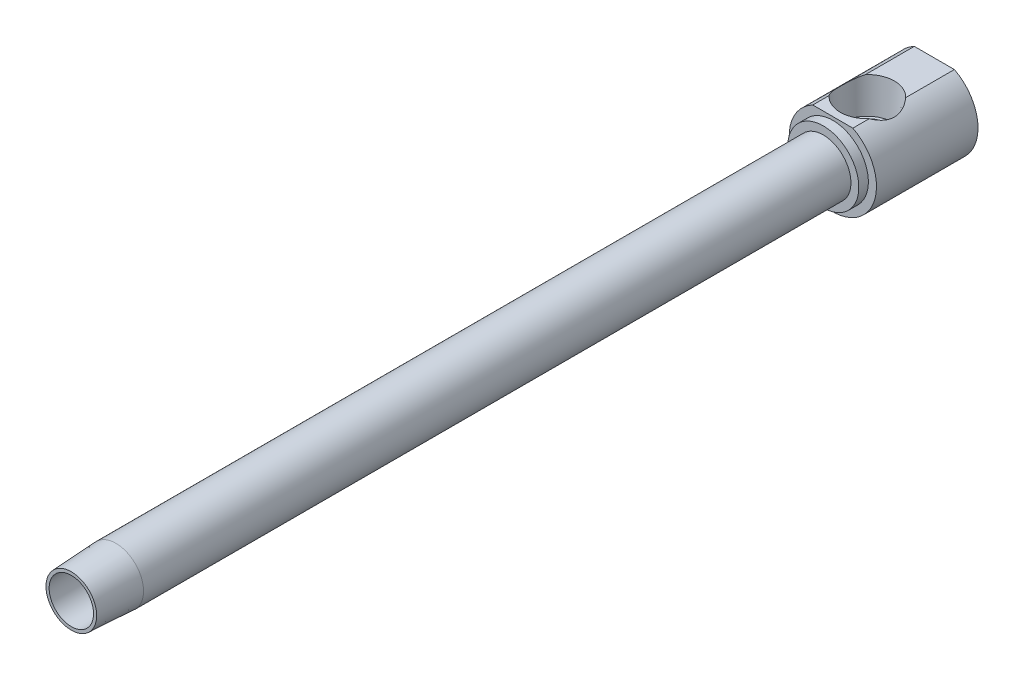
ISO-10303-21;
HEADER;
FILE_DESCRIPTION(('STEP AP214'),'2;1');
FILE_NAME('part.step','',(''),(''),'','','');
FILE_SCHEMA(('AUTOMOTIVE_DESIGN { 1 0 10303 214 1 1 1 1 }'));
ENDSEC;
DATA;
#1=APPLICATION_CONTEXT('core data for automotive mechanical design processes');
#2=APPLICATION_PROTOCOL_DEFINITION('international standard','automotive_design',2000,#1);
#3=PRODUCT_CONTEXT('',#1,'mechanical');
#4=PRODUCT('Part','Part','',(#3));
#5=PRODUCT_RELATED_PRODUCT_CATEGORY('part','',(#4));
#6=PRODUCT_DEFINITION_FORMATION('','',#4);
#7=PRODUCT_DEFINITION_CONTEXT('part definition',#1,'design');
#8=PRODUCT_DEFINITION('design','',#6,#7);
#9=PRODUCT_DEFINITION_SHAPE('','',#8);
#10=(LENGTH_UNIT() NAMED_UNIT(*) SI_UNIT(.MILLI.,.METRE.));
#11=(NAMED_UNIT(*) PLANE_ANGLE_UNIT() SI_UNIT($,.RADIAN.));
#12=(NAMED_UNIT(*) SI_UNIT($,.STERADIAN.) SOLID_ANGLE_UNIT());
#13=UNCERTAINTY_MEASURE_WITH_UNIT(LENGTH_MEASURE(1.E-05),#10,'distance_accuracy_value','');
#14=(GEOMETRIC_REPRESENTATION_CONTEXT(3) GLOBAL_UNCERTAINTY_ASSIGNED_CONTEXT((#13)) GLOBAL_UNIT_ASSIGNED_CONTEXT((#10,
#11,#12)) REPRESENTATION_CONTEXT('',''));
#15=CARTESIAN_POINT('',(0.,0.,0.));
#16=DIRECTION('',(0.,0.,1.));
#17=DIRECTION('',(1.,0.,0.));
#18=AXIS2_PLACEMENT_3D('',#15,#16,#17);
#19=CARTESIAN_POINT('',(0.,0.,-249.822166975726));
#20=DIRECTION('',(0.,0.,-1.));
#21=DIRECTION('',(-1.,0.,0.));
#22=AXIS2_PLACEMENT_3D('',#19,#20,#21);
#23=CYLINDRICAL_SURFACE('',#22,6.9215);
#24=CARTESIAN_POINT('',(0.,0.,-11.1472000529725));
#25=DIRECTION('',(0.,0.,-1.));
#26=DIRECTION('',(-1.,0.,0.));
#27=AXIS2_PLACEMENT_3D('',#24,#25,#26);
#28=CIRCLE('',#27,6.9215);
#29=CARTESIAN_POINT('',(-6.9215,0.,-11.1472000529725));
#30=VERTEX_POINT('',#29);
#31=EDGE_CURVE('E260',#30,#30,#28,.T.);
#32=ORIENTED_EDGE('',*,*,#31,.T.);
#33=EDGE_LOOP('',(#32));
#34=FACE_BOUND('',#33,.T.);
#35=CARTESIAN_POINT('',(0.,0.,-188.1124));
#36=DIRECTION('',(0.,0.,-1.));
#37=DIRECTION('',(-1.,0.,0.));
#38=AXIS2_PLACEMENT_3D('',#35,#36,#37);
#39=CIRCLE('',#38,6.9215);
#40=CARTESIAN_POINT('',(-6.9215,0.,-188.1124));
#41=VERTEX_POINT('',#40);
#42=EDGE_CURVE('E230',#41,#41,#39,.T.);
#43=ORIENTED_EDGE('',*,*,#42,.F.);
#44=EDGE_LOOP('',(#43));
#45=FACE_BOUND('',#44,.T.);
#46=ADVANCED_FACE('F15',(#34,#45),#23,.T.);
#47=CARTESIAN_POINT('',(-5.0165,9.70179425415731,-174.625));
#48=DIRECTION('',(0.,-1.,0.));
#49=DIRECTION('',(0.,0.,-1.));
#50=AXIS2_PLACEMENT_3D('',#47,#48,#49);
#51=PLANE('',#50);
#52=DIRECTION('',(0.,0.,-1.));
#53=VECTOR('',#52,1.);
#54=CARTESIAN_POINT('',(5.0165,9.70179425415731,-174.625));
#55=LINE('',#54,#53);
#56=CARTESIAN_POINT('',(5.0165,9.70179425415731,-190.5));
#57=VERTEX_POINT('',#56);
#58=CARTESIAN_POINT('',(5.0165,9.70179425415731,-194.580663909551));
#59=VERTEX_POINT('',#58);
#60=EDGE_CURVE('E222',#57,#59,#55,.T.);
#61=ORIENTED_EDGE('',*,*,#60,.T.);
#62=CARTESIAN_POINT('',(0.,9.70179425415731,-199.136));
#63=DIRECTION('',(0.,-1.,0.));
#64=DIRECTION('',(0.,0.,-1.));
#65=AXIS2_PLACEMENT_3D('',#62,#63,#64);
#66=CIRCLE('',#65,6.77616109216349);
#67=CARTESIAN_POINT('',(-5.0165,9.70179425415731,-194.580663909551));
#68=VERTEX_POINT('',#67);
#69=EDGE_CURVE('E10',#59,#68,#66,.T.);
#70=ORIENTED_EDGE('',*,*,#69,.T.);
#71=DIRECTION('',(0.,0.,-1.));
#72=VECTOR('',#71,1.);
#73=CARTESIAN_POINT('',(-5.0165,9.70179425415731,-174.625));
#74=LINE('',#73,#72);
#75=CARTESIAN_POINT('',(-5.0165,9.70179425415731,-190.5));
#76=VERTEX_POINT('',#75);
#77=EDGE_CURVE('E229',#76,#68,#74,.T.);
#78=ORIENTED_EDGE('',*,*,#77,.F.);
#79=DIRECTION('',(1.,0.,0.));
#80=VECTOR('',#79,1.);
#81=CARTESIAN_POINT('',(-8.89,9.70179425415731,-190.5));
#82=LINE('',#81,#80);
#83=EDGE_CURVE('E192',#76,#57,#82,.T.);
#84=ORIENTED_EDGE('',*,*,#83,.T.);
#85=EDGE_LOOP('',(#61,#70,#78,#84));
#86=FACE_BOUND('',#85,.T.);
#87=ADVANCED_FACE('F128',(#86),#51,.F.);
#88=CARTESIAN_POINT('',(-5.55625,0.,-188.087));
#89=DIRECTION('',(0.,0.,1.));
#90=DIRECTION('',(1.,0.,0.));
#91=AXIS2_PLACEMENT_3D('',#88,#89,#90);
#92=PLANE('',#91);
#93=CARTESIAN_POINT('',(0.,0.,-188.087));
#94=DIRECTION('',(0.,0.,-1.));
#95=DIRECTION('',(-1.,0.,0.));
#96=AXIS2_PLACEMENT_3D('',#93,#94,#95);
#97=CIRCLE('',#96,5.55625);
#98=CARTESIAN_POINT('',(-5.55625,0.,-188.087));
#99=VERTEX_POINT('',#98);
#100=EDGE_CURVE('E243',#99,#99,#97,.T.);
#101=ORIENTED_EDGE('',*,*,#100,.F.);
#102=EDGE_LOOP('',(#101));
#103=FACE_BOUND('',#102,.T.);
#104=CARTESIAN_POINT('',(0.,-0.00757924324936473,-188.087));
#105=DIRECTION('',(0.,0.,1.));
#106=DIRECTION('',(0.,1.,0.));
#107=AXIS2_PLACEMENT_3D('',#104,#105,#106);
#108=ELLIPSE('',#107,5.22919092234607,4.47866855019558);
#109=CARTESIAN_POINT('',(0.,5.22161167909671,-188.087));
#110=VERTEX_POINT('',#109);
#111=EDGE_CURVE('E193',#110,#110,#108,.F.);
#112=ORIENTED_EDGE('',*,*,#111,.T.);
#113=EDGE_LOOP('',(#112));
#114=FACE_BOUND('',#113,.T.);
#115=ADVANCED_FACE('F134',(#103,#114),#92,.T.);
#116=CARTESIAN_POINT('',(-5.55625,0.,0.));
#117=DIRECTION('',(0.,0.,1.));
#118=DIRECTION('',(1.,0.,0.));
#119=AXIS2_PLACEMENT_3D('',#116,#117,#118);
#120=PLANE('',#119);
#121=CARTESIAN_POINT('',(0.,0.,0.));
#122=DIRECTION('',(0.,0.,-1.));
#123=DIRECTION('',(-1.,0.,0.));
#124=AXIS2_PLACEMENT_3D('',#121,#122,#123);
#125=CIRCLE('',#124,6.3373);
#126=CARTESIAN_POINT('',(-6.3373,0.,0.));
#127=VERTEX_POINT('',#126);
#128=EDGE_CURVE('E257',#127,#127,#125,.T.);
#129=ORIENTED_EDGE('',*,*,#128,.F.);
#130=EDGE_LOOP('',(#129));
#131=FACE_BOUND('',#130,.T.);
#132=CARTESIAN_POINT('',(0.,0.,0.));
#133=DIRECTION('',(0.,0.,-1.));
#134=DIRECTION('',(-1.,0.,0.));
#135=AXIS2_PLACEMENT_3D('',#132,#133,#134);
#136=CIRCLE('',#135,5.55625);
#137=CARTESIAN_POINT('',(-5.55625,0.,0.));
#138=VERTEX_POINT('',#137);
#139=EDGE_CURVE('E19',#138,#138,#136,.T.);
#140=ORIENTED_EDGE('',*,*,#139,.T.);
#141=EDGE_LOOP('',(#140));
#142=FACE_BOUND('',#141,.T.);
#143=ADVANCED_FACE('F17',(#131,#142),#120,.T.);
#144=CARTESIAN_POINT('',(0.,0.,-249.822166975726));
#145=DIRECTION('',(0.,0.,-1.));
#146=DIRECTION('',(-1.,0.,0.));
#147=AXIS2_PLACEMENT_3D('',#144,#145,#146);
#148=CYLINDRICAL_SURFACE('',#147,5.55625);
#149=ORIENTED_EDGE('',*,*,#100,.T.);
#150=EDGE_LOOP('',(#149));
#151=FACE_BOUND('',#150,.T.);
#152=ORIENTED_EDGE('',*,*,#139,.F.);
#153=EDGE_LOOP('',(#152));
#154=FACE_BOUND('',#153,.T.);
#155=ADVANCED_FACE('F141',(#151,#154),#148,.F.);
#156=CARTESIAN_POINT('',(-10.922,0.,-215.9));
#157=DIRECTION('',(0.,0.,-1.));
#158=DIRECTION('',(-1.,0.,0.));
#159=AXIS2_PLACEMENT_3D('',#156,#157,#158);
#160=PLANE('',#159);
#161=DIRECTION('',(1.,0.,0.));
#162=VECTOR('',#161,1.);
#163=CARTESIAN_POINT('',(-2.7496306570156,4.7625,-215.9));
#164=LINE('',#163,#162);
#165=CARTESIAN_POINT('',(-2.7496306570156,4.7625,-215.9));
#166=VERTEX_POINT('',#165);
#167=CARTESIAN_POINT('',(2.7496306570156,4.7625,-215.9));
#168=VERTEX_POINT('',#167);
#169=EDGE_CURVE('E353',#166,#168,#164,.T.);
#170=ORIENTED_EDGE('',*,*,#169,.F.);
#171=DIRECTION('',(0.5,0.866025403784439,0.));
#172=VECTOR('',#171,1.);
#173=CARTESIAN_POINT('',(-5.49926131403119,0.,-215.9));
#174=LINE('',#173,#172);
#175=CARTESIAN_POINT('',(-5.49926131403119,0.,-215.9));
#176=VERTEX_POINT('',#175);
#177=EDGE_CURVE('E338',#176,#166,#174,.T.);
#178=ORIENTED_EDGE('',*,*,#177,.F.);
#179=DIRECTION('',(-0.5,0.866025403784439,0.));
#180=VECTOR('',#179,1.);
#181=CARTESIAN_POINT('',(-2.7496306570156,-4.7625,-215.9));
#182=LINE('',#181,#180);
#183=CARTESIAN_POINT('',(-2.7496306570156,-4.7625,-215.9));
#184=VERTEX_POINT('',#183);
#185=EDGE_CURVE('E342',#184,#176,#182,.T.);
#186=ORIENTED_EDGE('',*,*,#185,.F.);
#187=DIRECTION('',(-1.,0.,0.));
#188=VECTOR('',#187,1.);
#189=CARTESIAN_POINT('',(2.74963065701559,-4.7625,-215.9));
#190=LINE('',#189,#188);
#191=CARTESIAN_POINT('',(2.74963065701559,-4.7625,-215.9));
#192=VERTEX_POINT('',#191);
#193=EDGE_CURVE('E361',#192,#184,#190,.T.);
#194=ORIENTED_EDGE('',*,*,#193,.F.);
#195=DIRECTION('',(-0.5,-0.866025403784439,0.));
#196=VECTOR('',#195,1.);
#197=CARTESIAN_POINT('',(5.49926131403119,0.,-215.9));
#198=LINE('',#197,#196);
#199=CARTESIAN_POINT('',(5.49926131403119,0.,-215.9));
#200=VERTEX_POINT('',#199);
#201=EDGE_CURVE('E358',#200,#192,#198,.T.);
#202=ORIENTED_EDGE('',*,*,#201,.F.);
#203=DIRECTION('',(0.5,-0.866025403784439,0.));
#204=VECTOR('',#203,1.);
#205=CARTESIAN_POINT('',(2.7496306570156,4.7625,-215.9));
#206=LINE('',#205,#204);
#207=EDGE_CURVE('E355',#168,#200,#206,.T.);
#208=ORIENTED_EDGE('',*,*,#207,.F.);
#209=EDGE_LOOP('',(#170,#178,#186,#194,#202,#208));
#210=FACE_BOUND('',#209,.T.);
#211=DIRECTION('',(-1.,0.,0.));
#212=VECTOR('',#211,1.);
#213=CARTESIAN_POINT('',(-5.0165,9.70179425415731,-215.9));
#214=LINE('',#213,#212);
#215=CARTESIAN_POINT('',(5.0165,9.70179425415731,-215.9));
#216=VERTEX_POINT('',#215);
#217=CARTESIAN_POINT('',(-5.0165,9.70179425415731,-215.9));
#218=VERTEX_POINT('',#217);
#219=EDGE_CURVE('E223',#216,#218,#214,.T.);
#220=ORIENTED_EDGE('',*,*,#219,.F.);
#221=CARTESIAN_POINT('',(0.,0.,-215.9));
#222=DIRECTION('',(0.,0.,-1.));
#223=DIRECTION('',(-1.,0.,0.));
#224=AXIS2_PLACEMENT_3D('',#221,#222,#223);
#225=CIRCLE('',#224,10.922);
#226=EDGE_CURVE('E221',#216,#218,#225,.T.);
#227=ORIENTED_EDGE('',*,*,#226,.T.);
#228=EDGE_LOOP('',(#220,#227));
#229=FACE_BOUND('',#228,.T.);
#230=ADVANCED_FACE('F144',(#210,#229),#160,.T.);
#231=CARTESIAN_POINT('',(0.,0.,-249.822166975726));
#232=DIRECTION('',(0.,0.,-1.));
#233=DIRECTION('',(-1.,0.,0.));
#234=AXIS2_PLACEMENT_3D('',#231,#232,#233);
#235=CYLINDRICAL_SURFACE('',#234,10.922);
#236=CARTESIAN_POINT('',(5.01611318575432,9.70199425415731,-194.580222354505));
#237=CARTESIAN_POINT('',(5.13874600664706,9.63860171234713,-194.720215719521));
#238=CARTESIAN_POINT('',(5.25564164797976,9.57520664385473,-194.865256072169));
#239=CARTESIAN_POINT('',(5.47752086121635,9.45002813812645,-195.164981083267));
#240=CARTESIAN_POINT('',(5.58249714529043,9.38824570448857,-195.319671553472));
#241=CARTESIAN_POINT('',(5.78097274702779,9.2673671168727,-195.639725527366));
#242=CARTESIAN_POINT('',(5.87434183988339,9.20830544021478,-195.80518303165));
#243=CARTESIAN_POINT('',(6.0476637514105,9.09541327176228,-196.144678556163));
#244=CARTESIAN_POINT('',(6.12761848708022,9.04158203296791,-196.318715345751));
#245=CARTESIAN_POINT('',(6.27379640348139,8.94077724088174,-196.675643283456));
#246=CARTESIAN_POINT('',(6.33993919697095,8.89384428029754,-196.858579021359));
#247=CARTESIAN_POINT('',(6.45706504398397,8.80917858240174,-197.231294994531));
#248=CARTESIAN_POINT('',(6.50805163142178,8.77144370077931,-197.421073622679));
#249=CARTESIAN_POINT('',(6.59383346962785,8.70714156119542,-197.805114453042));
#250=CARTESIAN_POINT('',(6.62870831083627,8.68051947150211,-197.999349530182));
#251=CARTESIAN_POINT('',(6.68193856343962,8.63961377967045,-198.391343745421));
#252=CARTESIAN_POINT('',(6.70029794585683,8.6253272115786,-198.589102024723));
#253=CARTESIAN_POINT('',(6.71863048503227,8.61105017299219,-198.95650037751));
#254=CARTESIAN_POINT('',(6.72092722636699,8.6092532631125,-199.125959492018));
#255=CARTESIAN_POINT('',(6.71322085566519,8.61526418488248,-199.464414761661));
#256=CARTESIAN_POINT('',(6.70321892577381,8.6230710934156,-199.633410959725));
#257=CARTESIAN_POINT('',(6.67106070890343,8.64797346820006,-199.969752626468));
#258=CARTESIAN_POINT('',(6.64888985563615,8.66508006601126,-200.137095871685));
#259=CARTESIAN_POINT('',(6.59274566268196,8.70787088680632,-200.468631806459));
#260=CARTESIAN_POINT('',(6.55877214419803,8.73355523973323,-200.632824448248));
#261=CARTESIAN_POINT('',(6.44503992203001,8.81817206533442,-201.097696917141));
#262=CARTESIAN_POINT('',(6.35112179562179,8.88662503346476,-201.393302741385));
#263=CARTESIAN_POINT('',(6.12702756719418,9.04257250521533,-201.964869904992));
#264=CARTESIAN_POINT('',(5.99683851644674,9.13007380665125,-202.240824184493));
#265=CARTESIAN_POINT('',(5.73165005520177,9.2982747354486,-202.718944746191));
#266=CARTESIAN_POINT('',(5.60244827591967,9.37701803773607,-202.925061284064));
#267=CARTESIAN_POINT('',(5.32402625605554,9.53785679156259,-203.320821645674));
#268=CARTESIAN_POINT('',(5.17487070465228,9.61994083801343,-203.510515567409));
#269=CARTESIAN_POINT('',(5.01611318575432,9.70199425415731,-203.691777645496));
#270=B_SPLINE_CURVE_WITH_KNOTS('',3,(#236,#237,#238,#239,#240,#241,#242,#243,#244,#245,#246,
#247,#248,#249,#250,#251,#252,#253,#254,#255,#256,#257,#258,#259,#260,#261,#262,#263,#264,#265,
#266,#267,#268,#269),.UNSPECIFIED.,.F.,.F.,(4,2,2,2,2,2,2,2,2,2,2,2,2,2,2,2,4),(0.,
0.589708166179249,1.17977497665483,1.77595731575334,2.37205438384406,2.97152964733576,
3.57086502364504,4.16720722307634,4.76340599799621,5.27115701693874,5.778859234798,
6.28717050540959,6.79548947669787,7.74447500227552,8.69379975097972,9.4595634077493,
10.222902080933),.UNSPECIFIED.);
#271=CARTESIAN_POINT('',(5.0165,9.70179425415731,-203.69133609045));
#272=VERTEX_POINT('',#271);
#273=EDGE_CURVE('E31',#59,#272,#270,.T.);
#274=ORIENTED_EDGE('',*,*,#273,.F.);
#275=ORIENTED_EDGE('',*,*,#60,.F.);
#276=CARTESIAN_POINT('',(0.,0.,-190.5));
#277=DIRECTION('',(0.,0.,-1.));
#278=DIRECTION('',(-1.,0.,0.));
#279=AXIS2_PLACEMENT_3D('',#276,#277,#278);
#280=CIRCLE('',#279,10.922);
#281=EDGE_CURVE('E239',#57,#76,#280,.T.);
#282=ORIENTED_EDGE('',*,*,#281,.T.);
#283=ORIENTED_EDGE('',*,*,#77,.T.);
#284=CARTESIAN_POINT('',(-5.01611318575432,9.70199425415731,-203.691777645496));
#285=CARTESIAN_POINT('',(-5.13874600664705,9.63860171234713,-203.551784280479));
#286=CARTESIAN_POINT('',(-5.25564164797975,9.57520664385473,-203.406743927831));
#287=CARTESIAN_POINT('',(-5.47752086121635,9.45002813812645,-203.107018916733));
#288=CARTESIAN_POINT('',(-5.58249714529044,9.38824570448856,-202.952328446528));
#289=CARTESIAN_POINT('',(-5.7809727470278,9.26736711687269,-202.632274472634));
#290=CARTESIAN_POINT('',(-5.8743418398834,9.20830544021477,-202.46681696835));
#291=CARTESIAN_POINT('',(-6.04766375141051,9.09541327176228,-202.127321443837));
#292=CARTESIAN_POINT('',(-6.12761848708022,9.04158203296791,-201.953284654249));
#293=CARTESIAN_POINT('',(-6.27379640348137,8.94077724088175,-201.596356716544));
#294=CARTESIAN_POINT('',(-6.33993919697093,8.89384428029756,-201.413420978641));
#295=CARTESIAN_POINT('',(-6.45706504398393,8.80917858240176,-201.040705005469));
#296=CARTESIAN_POINT('',(-6.50805163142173,8.77144370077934,-200.850926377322));
#297=CARTESIAN_POINT('',(-6.5938334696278,8.70714156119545,-200.466885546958));
#298=CARTESIAN_POINT('',(-6.62870831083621,8.68051947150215,-200.272650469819));
#299=CARTESIAN_POINT('',(-6.68193856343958,8.63961377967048,-199.88065625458));
#300=CARTESIAN_POINT('',(-6.70029794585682,8.62532721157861,-199.682897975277));
#301=CARTESIAN_POINT('',(-6.71863048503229,8.61105017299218,-199.31549962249));
#302=CARTESIAN_POINT('',(-6.720927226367,8.6092532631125,-199.146040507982));
#303=CARTESIAN_POINT('',(-6.7132208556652,8.61526418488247,-198.80758523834));
#304=CARTESIAN_POINT('',(-6.70321892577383,8.62307109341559,-198.638589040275));
#305=CARTESIAN_POINT('',(-6.67106070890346,8.64797346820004,-198.302247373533));
#306=CARTESIAN_POINT('',(-6.64888985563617,8.66508006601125,-198.134904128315));
#307=CARTESIAN_POINT('',(-6.59274566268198,8.70787088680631,-197.803368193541));
#308=CARTESIAN_POINT('',(-6.55877214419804,8.73355523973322,-197.639175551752));
#309=CARTESIAN_POINT('',(-6.44503992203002,8.81817206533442,-197.174303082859));
#310=CARTESIAN_POINT('',(-6.35112179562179,8.88662503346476,-196.878697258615));
#311=CARTESIAN_POINT('',(-6.12702756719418,9.04257250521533,-196.307130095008));
#312=CARTESIAN_POINT('',(-5.99683851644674,9.13007380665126,-196.031175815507));
#313=CARTESIAN_POINT('',(-5.73165005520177,9.2982747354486,-195.553055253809));
#314=CARTESIAN_POINT('',(-5.60244827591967,9.37701803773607,-195.346938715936));
#315=CARTESIAN_POINT('',(-5.32402625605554,9.53785679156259,-194.951178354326));
#316=CARTESIAN_POINT('',(-5.17487070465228,9.61994083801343,-194.761484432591));
#317=CARTESIAN_POINT('',(-5.01611318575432,9.70199425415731,-194.580222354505));
#318=B_SPLINE_CURVE_WITH_KNOTS('',3,(#284,#285,#286,#287,#288,#289,#290,#291,#292,#293,#294,
#295,#296,#297,#298,#299,#300,#301,#302,#303,#304,#305,#306,#307,#308,#309,#310,#311,#312,#313,
#314,#315,#316,#317),.UNSPECIFIED.,.F.,.F.,(4,2,2,2,2,2,2,2,2,2,2,2,2,2,2,2,4),(0.,
0.589708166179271,1.17977497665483,1.77595731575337,2.37205438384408,2.97152964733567,
3.57086502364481,4.167207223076,4.76340599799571,5.27115701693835,5.77885923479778,
6.28717050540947,6.7954894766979,7.74447500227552,8.69379975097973,9.4595634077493,
10.222902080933),.UNSPECIFIED.);
#319=CARTESIAN_POINT('',(-5.0165,9.70179425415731,-203.69133609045));
#320=VERTEX_POINT('',#319);
#321=EDGE_CURVE('E161',#320,#68,#318,.T.);
#322=ORIENTED_EDGE('',*,*,#321,.F.);
#323=EDGE_CURVE('E215',#320,#218,#74,.T.);
#324=ORIENTED_EDGE('',*,*,#323,.T.);
#325=ORIENTED_EDGE('',*,*,#226,.F.);
#326=EDGE_CURVE('E213',#272,#216,#55,.T.);
#327=ORIENTED_EDGE('',*,*,#326,.F.);
#328=EDGE_LOOP('',(#274,#275,#282,#283,#322,#324,#325,#327));
#329=FACE_BOUND('',#328,.T.);
#330=ADVANCED_FACE('F151',(#329),#235,.T.);
#331=CARTESIAN_POINT('',(-8.89,0.,-190.5));
#332=DIRECTION('',(0.,0.,1.));
#333=DIRECTION('',(1.,0.,0.));
#334=AXIS2_PLACEMENT_3D('',#331,#332,#333);
#335=PLANE('',#334);
#336=ORIENTED_EDGE('',*,*,#83,.F.);
#337=ORIENTED_EDGE('',*,*,#281,.F.);
#338=EDGE_LOOP('',(#336,#337));
#339=FACE_BOUND('',#338,.T.);
#340=CARTESIAN_POINT('',(0.,0.,-190.5));
#341=DIRECTION('',(0.,0.,-1.));
#342=DIRECTION('',(-1.,0.,0.));
#343=AXIS2_PLACEMENT_3D('',#340,#341,#342);
#344=CIRCLE('',#343,8.89);
#345=CARTESIAN_POINT('',(-8.89,0.,-190.5));
#346=VERTEX_POINT('',#345);
#347=EDGE_CURVE('E236',#346,#346,#344,.T.);
#348=ORIENTED_EDGE('',*,*,#347,.T.);
#349=EDGE_LOOP('',(#348));
#350=FACE_BOUND('',#349,.T.);
#351=ADVANCED_FACE('F156',(#339,#350),#335,.T.);
#352=CARTESIAN_POINT('',(0.,0.,-249.822166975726));
#353=DIRECTION('',(0.,0.,-1.));
#354=DIRECTION('',(-1.,0.,0.));
#355=AXIS2_PLACEMENT_3D('',#352,#353,#354);
#356=CYLINDRICAL_SURFACE('',#355,8.89);
#357=CARTESIAN_POINT('',(0.,0.,-188.1124));
#358=DIRECTION('',(0.,0.,-1.));
#359=DIRECTION('',(-1.,0.,0.));
#360=AXIS2_PLACEMENT_3D('',#357,#358,#359);
#361=CIRCLE('',#360,8.89);
#362=CARTESIAN_POINT('',(-8.89,0.,-188.1124));
#363=VERTEX_POINT('',#362);
#364=EDGE_CURVE('E233',#363,#363,#361,.T.);
#365=ORIENTED_EDGE('',*,*,#364,.T.);
#366=EDGE_LOOP('',(#365));
#367=FACE_BOUND('',#366,.T.);
#368=ORIENTED_EDGE('',*,*,#347,.F.);
#369=EDGE_LOOP('',(#368));
#370=FACE_BOUND('',#369,.T.);
#371=ADVANCED_FACE('F282',(#367,#370),#356,.T.);
#372=CARTESIAN_POINT('',(-6.9215,0.,-188.1124));
#373=DIRECTION('',(0.,0.,1.));
#374=DIRECTION('',(1.,0.,0.));
#375=AXIS2_PLACEMENT_3D('',#372,#373,#374);
#376=PLANE('',#375);
#377=ORIENTED_EDGE('',*,*,#42,.T.);
#378=EDGE_LOOP('',(#377));
#379=FACE_BOUND('',#378,.T.);
#380=ORIENTED_EDGE('',*,*,#364,.F.);
#381=EDGE_LOOP('',(#380));
#382=FACE_BOUND('',#381,.T.);
#383=ADVANCED_FACE('F286',(#379,#382),#376,.T.);
#384=ORIENTED_EDGE('',*,*,#323,.F.);
#385=EDGE_CURVE('E24',#320,#272,#66,.T.);
#386=ORIENTED_EDGE('',*,*,#385,.T.);
#387=ORIENTED_EDGE('',*,*,#326,.T.);
#388=ORIENTED_EDGE('',*,*,#219,.T.);
#389=EDGE_LOOP('',(#384,#386,#387,#388));
#390=FACE_BOUND('',#389,.T.);
#391=ADVANCED_FACE('F137',(#390),#51,.F.);
#392=CARTESIAN_POINT('',(-2.7496306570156,4.7625,-209.55));
#393=DIRECTION('',(0.,1.,0.));
#394=DIRECTION('',(0.,0.,1.));
#395=AXIS2_PLACEMENT_3D('',#392,#393,#394);
#396=PLANE('',#395);
#397=ORIENTED_EDGE('',*,*,#169,.T.);
#398=DIRECTION('',(0.,0.,-1.));
#399=VECTOR('',#398,1.);
#400=CARTESIAN_POINT('',(2.7496306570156,4.7625,-209.55));
#401=LINE('',#400,#399);
#402=CARTESIAN_POINT('',(2.7496306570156,4.7625,-209.55));
#403=VERTEX_POINT('',#402);
#404=EDGE_CURVE('E352',#403,#168,#401,.T.);
#405=ORIENTED_EDGE('',*,*,#404,.F.);
#406=DIRECTION('',(1.,0.,0.));
#407=VECTOR('',#406,1.);
#408=CARTESIAN_POINT('',(-2.7496306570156,4.7625,-209.55));
#409=LINE('',#408,#407);
#410=CARTESIAN_POINT('',(-2.7496306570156,4.7625,-209.55));
#411=VERTEX_POINT('',#410);
#412=EDGE_CURVE('E331',#411,#403,#409,.T.);
#413=ORIENTED_EDGE('',*,*,#412,.F.);
#414=DIRECTION('',(0.,0.,-1.));
#415=VECTOR('',#414,1.);
#416=CARTESIAN_POINT('',(-2.7496306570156,4.7625,-209.55));
#417=LINE('',#416,#415);
#418=EDGE_CURVE('E225',#411,#166,#417,.T.);
#419=ORIENTED_EDGE('',*,*,#418,.T.);
#420=EDGE_LOOP('',(#397,#405,#413,#419));
#421=FACE_BOUND('',#420,.T.);
#422=ADVANCED_FACE('F296',(#421),#396,.F.);
#423=CARTESIAN_POINT('',(-5.49926131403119,0.,-209.55));
#424=DIRECTION('',(-0.866025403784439,0.5,0.));
#425=DIRECTION('',(-0.5,-0.866025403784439,0.));
#426=AXIS2_PLACEMENT_3D('',#423,#424,#425);
#427=PLANE('',#426);
#428=ORIENTED_EDGE('',*,*,#177,.T.);
#429=ORIENTED_EDGE('',*,*,#418,.F.);
#430=DIRECTION('',(0.5,0.866025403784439,0.));
#431=VECTOR('',#430,1.);
#432=CARTESIAN_POINT('',(-5.49926131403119,0.,-209.55));
#433=LINE('',#432,#431);
#434=CARTESIAN_POINT('',(-5.49926131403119,0.,-209.55));
#435=VERTEX_POINT('',#434);
#436=EDGE_CURVE('E337',#435,#411,#433,.T.);
#437=ORIENTED_EDGE('',*,*,#436,.F.);
#438=DIRECTION('',(0.,0.,-1.));
#439=VECTOR('',#438,1.);
#440=CARTESIAN_POINT('',(-5.49926131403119,0.,-209.55));
#441=LINE('',#440,#439);
#442=EDGE_CURVE('E367',#435,#176,#441,.T.);
#443=ORIENTED_EDGE('',*,*,#442,.T.);
#444=EDGE_LOOP('',(#428,#429,#437,#443));
#445=FACE_BOUND('',#444,.T.);
#446=ADVANCED_FACE('F299',(#445),#427,.F.);
#447=CARTESIAN_POINT('',(-2.7496306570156,-4.7625,-209.55));
#448=DIRECTION('',(-0.866025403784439,-0.5,0.));
#449=DIRECTION('',(0.5,-0.866025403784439,0.));
#450=AXIS2_PLACEMENT_3D('',#447,#448,#449);
#451=PLANE('',#450);
#452=ORIENTED_EDGE('',*,*,#185,.T.);
#453=ORIENTED_EDGE('',*,*,#442,.F.);
#454=DIRECTION('',(-0.5,0.866025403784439,0.));
#455=VECTOR('',#454,1.);
#456=CARTESIAN_POINT('',(-2.7496306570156,-4.7625,-209.55));
#457=LINE('',#456,#455);
#458=CARTESIAN_POINT('',(-2.7496306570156,-4.7625,-209.55));
#459=VERTEX_POINT('',#458);
#460=EDGE_CURVE('E349',#459,#435,#457,.T.);
#461=ORIENTED_EDGE('',*,*,#460,.F.);
#462=DIRECTION('',(0.,0.,-1.));
#463=VECTOR('',#462,1.);
#464=CARTESIAN_POINT('',(-2.7496306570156,-4.7625,-209.55));
#465=LINE('',#464,#463);
#466=EDGE_CURVE('E369',#459,#184,#465,.T.);
#467=ORIENTED_EDGE('',*,*,#466,.T.);
#468=EDGE_LOOP('',(#452,#453,#461,#467));
#469=FACE_BOUND('',#468,.T.);
#470=ADVANCED_FACE('F313',(#469),#451,.F.);
#471=CARTESIAN_POINT('',(2.74963065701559,-4.7625,-209.55));
#472=DIRECTION('',(0.,-1.,0.));
#473=DIRECTION('',(1.,0.,0.));
#474=AXIS2_PLACEMENT_3D('',#471,#472,#473);
#475=PLANE('',#474);
#476=ORIENTED_EDGE('',*,*,#193,.T.);
#477=ORIENTED_EDGE('',*,*,#466,.F.);
#478=DIRECTION('',(-1.,0.,0.));
#479=VECTOR('',#478,1.);
#480=CARTESIAN_POINT('',(2.74963065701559,-4.7625,-209.55));
#481=LINE('',#480,#479);
#482=CARTESIAN_POINT('',(2.74963065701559,-4.7625,-209.55));
#483=VERTEX_POINT('',#482);
#484=EDGE_CURVE('E346',#483,#459,#481,.T.);
#485=ORIENTED_EDGE('',*,*,#484,.F.);
#486=DIRECTION('',(0.,0.,-1.));
#487=VECTOR('',#486,1.);
#488=CARTESIAN_POINT('',(2.74963065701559,-4.7625,-209.55));
#489=LINE('',#488,#487);
#490=EDGE_CURVE('E371',#483,#192,#489,.T.);
#491=ORIENTED_EDGE('',*,*,#490,.T.);
#492=EDGE_LOOP('',(#476,#477,#485,#491));
#493=FACE_BOUND('',#492,.T.);
#494=ADVANCED_FACE('F309',(#493),#475,.F.);
#495=CARTESIAN_POINT('',(5.49926131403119,0.,-209.55));
#496=DIRECTION('',(0.866025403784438,-0.5,0.));
#497=DIRECTION('',(0.5,0.866025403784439,0.));
#498=AXIS2_PLACEMENT_3D('',#495,#496,#497);
#499=PLANE('',#498);
#500=ORIENTED_EDGE('',*,*,#201,.T.);
#501=ORIENTED_EDGE('',*,*,#490,.F.);
#502=DIRECTION('',(-0.5,-0.866025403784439,0.));
#503=VECTOR('',#502,1.);
#504=CARTESIAN_POINT('',(5.49926131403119,0.,-209.55));
#505=LINE('',#504,#503);
#506=CARTESIAN_POINT('',(5.49926131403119,0.,-209.55));
#507=VERTEX_POINT('',#506);
#508=EDGE_CURVE('E339',#507,#483,#505,.T.);
#509=ORIENTED_EDGE('',*,*,#508,.F.);
#510=DIRECTION('',(0.,0.,-1.));
#511=VECTOR('',#510,1.);
#512=CARTESIAN_POINT('',(5.49926131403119,0.,-209.55));
#513=LINE('',#512,#511);
#514=EDGE_CURVE('E373',#507,#200,#513,.T.);
#515=ORIENTED_EDGE('',*,*,#514,.T.);
#516=EDGE_LOOP('',(#500,#501,#509,#515));
#517=FACE_BOUND('',#516,.T.);
#518=ADVANCED_FACE('F305',(#517),#499,.F.);
#519=CARTESIAN_POINT('',(2.7496306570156,4.7625,-209.55));
#520=DIRECTION('',(0.866025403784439,0.5,0.));
#521=DIRECTION('',(-0.5,0.866025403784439,0.));
#522=AXIS2_PLACEMENT_3D('',#519,#520,#521);
#523=PLANE('',#522);
#524=ORIENTED_EDGE('',*,*,#207,.T.);
#525=ORIENTED_EDGE('',*,*,#514,.F.);
#526=DIRECTION('',(0.5,-0.866025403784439,0.));
#527=VECTOR('',#526,1.);
#528=CARTESIAN_POINT('',(2.7496306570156,4.7625,-209.55));
#529=LINE('',#528,#527);
#530=EDGE_CURVE('E334',#403,#507,#529,.T.);
#531=ORIENTED_EDGE('',*,*,#530,.F.);
#532=ORIENTED_EDGE('',*,*,#404,.T.);
#533=EDGE_LOOP('',(#524,#525,#531,#532));
#534=FACE_BOUND('',#533,.T.);
#535=ADVANCED_FACE('F301',(#534),#523,.F.);
#536=CARTESIAN_POINT('',(0.,0.,-209.55));
#537=DIRECTION('',(0.,0.,-1.));
#538=DIRECTION('',(-1.,0.,0.));
#539=AXIS2_PLACEMENT_3D('',#536,#537,#538);
#540=PLANE('',#539);
#541=ORIENTED_EDGE('',*,*,#412,.T.);
#542=ORIENTED_EDGE('',*,*,#530,.T.);
#543=ORIENTED_EDGE('',*,*,#508,.T.);
#544=ORIENTED_EDGE('',*,*,#484,.T.);
#545=ORIENTED_EDGE('',*,*,#460,.T.);
#546=ORIENTED_EDGE('',*,*,#436,.T.);
#547=EDGE_LOOP('',(#541,#542,#543,#544,#545,#546));
#548=FACE_BOUND('',#547,.T.);
#549=ADVANCED_FACE('F304',(#548),#540,.T.);
#550=CARTESIAN_POINT('',(0.,-6.20347480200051,-197.470096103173));
#551=DIRECTION('',(0.,0.499512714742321,0.866306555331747));
#552=DIRECTION('',(0.,-0.866306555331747,0.499512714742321));
#553=AXIS2_PLACEMENT_3D('',#550,#551,#552);
#554=CONICAL_SURFACE('',#553,1.6057813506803,1.04663497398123);
#555=CARTESIAN_POINT('',(-1.60598135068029,-4.92366652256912,-197.892483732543));
#556=CARTESIAN_POINT('',(-1.54801586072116,-4.95680342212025,-197.91140561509));
#557=CARTESIAN_POINT('',(-1.48993744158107,-4.9898023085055,-197.930231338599));
#558=CARTESIAN_POINT('',(-1.37340604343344,-5.05537021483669,-197.967594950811));
#559=CARTESIAN_POINT('',(-1.31495289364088,-5.08793901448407,-197.986132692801));
#560=CARTESIAN_POINT('',(-1.19585116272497,-5.1534103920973,-198.023346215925));
#561=CARTESIAN_POINT('',(-1.1351886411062,-5.18629452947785,-198.042009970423));
#562=CARTESIAN_POINT('',(-1.01316854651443,-5.25107049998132,-198.078708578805));
#563=CARTESIAN_POINT('',(-0.951811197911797,-5.28296264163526,-198.096743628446));
#564=CARTESIAN_POINT('',(-0.839118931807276,-5.3396112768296,-198.128707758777));
#565=CARTESIAN_POINT('',(-0.787957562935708,-5.36462261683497,-198.142793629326));
#566=CARTESIAN_POINT('',(-0.684623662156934,-5.41302356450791,-198.169993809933));
#567=CARTESIAN_POINT('',(-0.632451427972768,-5.43641364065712,-198.183108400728));
#568=CARTESIAN_POINT('',(-0.527211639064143,-5.48038053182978,-198.207701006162));
#569=CARTESIAN_POINT('',(-0.474159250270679,-5.50098432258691,-198.219194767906));
#570=CARTESIAN_POINT('',(-0.36615294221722,-5.53798897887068,-198.239788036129));
#571=CARTESIAN_POINT('',(-0.311202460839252,-5.55439703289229,-198.24889163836));
#572=CARTESIAN_POINT('',(-0.22440451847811,-5.57453509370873,-198.260044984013));
#573=CARTESIAN_POINT('',(-0.193292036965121,-5.58064728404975,-198.263425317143));
#574=CARTESIAN_POINT('',(-0.130548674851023,-5.59030484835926,-198.268762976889));
#575=CARTESIAN_POINT('',(-0.0989180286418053,-5.59385135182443,-198.270720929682));
#576=CARTESIAN_POINT('',(-0.0355632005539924,-5.5980028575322,-198.273012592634));
#577=CARTESIAN_POINT('',(-0.00384036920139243,-5.59862312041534,-198.273354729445));
#578=CARTESIAN_POINT('',(0.059499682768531,-5.59689784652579,-198.272402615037));
#579=CARTESIAN_POINT('',(0.091116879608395,-5.59455168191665,-198.271108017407));
#580=CARTESIAN_POINT('',(0.198837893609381,-5.58181842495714,-198.264074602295));
#581=CARTESIAN_POINT('',(0.273911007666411,-5.56473069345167,-198.254627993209));
#582=CARTESIAN_POINT('',(0.384150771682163,-5.5319056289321,-198.236402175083));
#583=CARTESIAN_POINT('',(0.42088805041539,-5.51959035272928,-198.229553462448));
#584=CARTESIAN_POINT('',(0.493546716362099,-5.49323102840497,-198.214866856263));
#585=CARTESIAN_POINT('',(0.529468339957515,-5.479187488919,-198.207029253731));
#586=CARTESIAN_POINT('',(0.612782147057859,-5.44486829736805,-198.187841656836));
#587=CARTESIAN_POINT('',(0.65990084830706,-5.42410253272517,-198.17620641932));
#588=CARTESIAN_POINT('',(0.753260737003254,-5.38113317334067,-198.15207919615));
#589=CARTESIAN_POINT('',(0.799501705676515,-5.35892922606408,-198.139587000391));
#590=CARTESIAN_POINT('',(0.937391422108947,-5.29083562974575,-198.101207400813));
#591=CARTESIAN_POINT('',(1.02808532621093,-5.24351779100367,-198.074446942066));
#592=CARTESIAN_POINT('',(1.20042119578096,-5.15111024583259,-198.02204965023));
#593=CARTESIAN_POINT('',(1.28217710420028,-5.10617320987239,-197.996510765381));
#594=CARTESIAN_POINT('',(1.40412884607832,-5.03811359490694,-197.95776330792));
#595=CARTESIAN_POINT('',(1.44460336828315,-5.01535392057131,-197.944794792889));
#596=CARTESIAN_POINT('',(1.52539869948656,-4.96964276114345,-197.918728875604));
#597=CARTESIAN_POINT('',(1.56571951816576,-4.94669128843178,-197.905631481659));
#598=CARTESIAN_POINT('',(1.60598135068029,-4.92366652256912,-197.892483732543));
#599=B_SPLINE_CURVE_WITH_KNOTS('',3,(#555,#556,#557,#558,#559,#560,#561,#562,#563,#564,#565,
#566,#567,#568,#569,#570,#571,#572,#573,#574,#575,#576,#577,#578,#579,#580,#581,#582,#583,#584,
#585,#586,#587,#588,#589,#590,#591,#592,#593,#594,#595,#596,#597,#598),.UNSPECIFIED.,.F.,.F.,(4,
2,2,2,2,2,2,2,2,2,2,2,2,2,2,2,2,2,2,2,2,4),(0.,0.208197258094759,0.416497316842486,
0.630934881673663,0.845305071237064,1.02127406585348,1.19719199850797,1.37126163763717,
1.54503101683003,1.64057868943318,1.73608427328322,1.83109123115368,1.92611830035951,
2.15701869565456,2.27506343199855,2.3930735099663,2.55139683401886,2.70975911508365,
3.02689190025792,3.31705802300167,3.46169224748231,3.60631720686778),.UNSPECIFIED.);
#600=CARTESIAN_POINT('',(-1.11098322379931,-5.19906341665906,-198.049240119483));
#601=VERTEX_POINT('',#600);
#602=CARTESIAN_POINT('',(1.11098322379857,-5.19906341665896,-198.049240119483));
#603=VERTEX_POINT('',#602);
#604=EDGE_CURVE('E269',#601,#603,#599,.T.);
#605=ORIENTED_EDGE('',*,*,#604,.F.);
#606=CARTESIAN_POINT('',(0.,-6.20347480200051,-197.470096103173));
#607=DIRECTION('',(0.,-0.499512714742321,-0.866306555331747));
#608=DIRECTION('',(0.,0.866306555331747,-0.499512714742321));
#609=AXIS2_PLACEMENT_3D('',#606,#607,#608);
#610=CIRCLE('',#609,1.6057813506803);
#611=EDGE_CURVE('E172',#603,#601,#610,.T.);
#612=ORIENTED_EDGE('',*,*,#611,.F.);
#613=EDGE_LOOP('',(#605,#612));
#614=FACE_BOUND('',#613,.T.);
#615=CARTESIAN_POINT('',(0.,-6.66717404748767,-198.274291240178));
#616=VERTEX_POINT('',#615);
#617=VERTEX_LOOP('',#616);
#618=FACE_BOUND('',#617,.T.);
#619=ADVANCED_FACE('F123',(#614,#618),#554,.F.);
#620=CARTESIAN_POINT('',(0.,0.737834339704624,-185.431760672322));
#621=DIRECTION('',(0.,0.499512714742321,0.866306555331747));
#622=DIRECTION('',(0.,-0.866306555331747,0.499512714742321));
#623=AXIS2_PLACEMENT_3D('',#620,#621,#622);
#624=CONICAL_SURFACE('',#623,5.22642714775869,0.254883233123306);
#625=CARTESIAN_POINT('',(1.01196113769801,-5.32825795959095,-198.272404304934));
#626=CARTESIAN_POINT('',(1.03389680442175,-5.30065791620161,-198.224478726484));
#627=CARTESIAN_POINT('',(1.055404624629,-5.27289731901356,-198.176452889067));
#628=CARTESIAN_POINT('',(1.09769940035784,-5.2171123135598,-198.080240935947));
#629=CARTESIAN_POINT('',(1.11848639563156,-5.18908791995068,-198.032054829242));
#630=CARTESIAN_POINT('',(1.1799640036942,-5.10471123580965,-197.88732712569));
#631=CARTESIAN_POINT('',(1.21977960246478,-5.04804474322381,-197.790597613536));
#632=CARTESIAN_POINT('',(1.29773817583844,-4.93416916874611,-197.596847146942));
#633=CARTESIAN_POINT('',(1.33588180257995,-4.87696030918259,-197.499826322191));
#634=CARTESIAN_POINT('',(1.4109280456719,-4.76213227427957,-197.305540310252));
#635=CARTESIAN_POINT('',(1.44783058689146,-4.70451307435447,-197.208275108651));
#636=CARTESIAN_POINT('',(1.57544445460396,-4.50218372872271,-196.867289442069));
#637=CARTESIAN_POINT('',(1.66369168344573,-4.35670129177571,-196.623107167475));
#638=CARTESIAN_POINT('',(1.83681407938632,-4.06477004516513,-196.134128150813));
#639=CARTESIAN_POINT('',(1.92168912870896,-3.91832120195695,-195.8893313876));
#640=CARTESIAN_POINT('',(2.08932287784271,-3.62468896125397,-195.399100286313));
#641=CARTESIAN_POINT('',(2.17207941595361,-3.47750498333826,-195.153665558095));
#642=CARTESIAN_POINT('',(2.33601111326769,-3.18275206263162,-194.662542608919));
#643=CARTESIAN_POINT('',(2.41718646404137,-3.03518316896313,-194.416854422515));
#644=CARTESIAN_POINT('',(2.4978920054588,-2.88750711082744,-194.17108161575));
#645=B_SPLINE_CURVE_WITH_KNOTS('',3,(#625,#626,#627,#628,#629,#630,#631,#632,#633,#634,#635,
#636,#637,#638,#639,#640,#641,#642,#643,#644),.UNSPECIFIED.,.F.,.F.,(4,2,2,2,2,2,2,2,2,4),(0.,
0.178483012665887,0.356956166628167,0.713833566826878,1.07057050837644,1.42732900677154,
2.32014264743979,3.21298744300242,4.10670963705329,5.00032286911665),.UNSPECIFIED.);
#646=CARTESIAN_POINT('',(2.49778278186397,-2.88770711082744,-194.171414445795));
#647=VERTEX_POINT('',#646);
#648=EDGE_CURVE('E205',#603,#647,#645,.T.);
#649=ORIENTED_EDGE('',*,*,#648,.F.);
#650=ORIENTED_EDGE('',*,*,#611,.T.);
#651=CARTESIAN_POINT('',(-2.49789200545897,-2.88750711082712,-194.171081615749));
#652=CARTESIAN_POINT('',(-2.44770652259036,-2.9793905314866,-194.323991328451));
#653=CARTESIAN_POINT('',(-2.39731483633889,-3.07122429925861,-194.47686367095));
#654=CARTESIAN_POINT('',(-2.29600007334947,-3.25476046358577,-194.782515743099));
#655=CARTESIAN_POINT('',(-2.2450769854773,-3.34646285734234,-194.935295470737));
#656=CARTESIAN_POINT('',(-2.14254206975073,-3.52977268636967,-195.240858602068));
#657=CARTESIAN_POINT('',(-2.09092972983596,-3.62137998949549,-195.393641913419));
#658=CARTESIAN_POINT('',(-1.98688424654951,-3.80437404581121,-195.69905856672));
#659=CARTESIAN_POINT('',(-1.93445111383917,-3.89576080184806,-195.85169191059));
#660=CARTESIAN_POINT('',(-1.82863256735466,-4.07804970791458,-196.156449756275));
#661=CARTESIAN_POINT('',(-1.77524935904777,-4.16895247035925,-196.308574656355));
#662=CARTESIAN_POINT('',(-1.66707377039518,-4.3503481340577,-196.612567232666));
#663=CARTESIAN_POINT('',(-1.61228140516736,-4.44084103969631,-196.764434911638));
#664=CARTESIAN_POINT('',(-1.50075171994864,-4.6211977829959,-197.067759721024));
#665=CARTESIAN_POINT('',(-1.44401501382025,-4.71106180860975,-197.219216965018));
#666=CARTESIAN_POINT('',(-1.32768795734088,-4.88985939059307,-197.521580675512));
#667=CARTESIAN_POINT('',(-1.26809785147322,-4.97879302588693,-197.672487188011));
#668=CARTESIAN_POINT('',(-1.19073480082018,-5.08895406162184,-197.860524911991));
#669=CARTESIAN_POINT('',(-1.1751187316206,-5.11093553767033,-197.898101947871));
#670=CARTESIAN_POINT('',(-1.14355086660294,-5.15477909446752,-197.973185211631));
#671=CARTESIAN_POINT('',(-1.12759906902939,-5.17664117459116,-198.010691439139));
#672=CARTESIAN_POINT('',(-1.07914810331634,-5.24202332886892,-198.123097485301));
#673=CARTESIAN_POINT('',(-1.04606024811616,-5.28532942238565,-198.19786779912));
#674=CARTESIAN_POINT('',(-1.01196113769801,-5.32825795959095,-198.272404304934));
#675=B_SPLINE_CURVE_WITH_KNOTS('',3,(#651,#652,#653,#654,#655,#656,#657,#658,#659,#660,#661,
#662,#663,#664,#665,#666,#667,#668,#669,#670,#671,#672,#673,#674),.UNSPECIFIED.,.F.,.F.,(4,2,2,
2,2,2,2,2,2,2,2,4),(0.,0.555952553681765,1.11191677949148,1.66831997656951,2.22471595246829,
2.77995563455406,3.33518936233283,3.89024937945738,4.44526192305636,4.58401142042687,
4.72276164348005,5.00032427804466),.UNSPECIFIED.);
#676=CARTESIAN_POINT('',(-2.49778278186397,-2.88770711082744,-194.171414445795));
#677=VERTEX_POINT('',#676);
#678=EDGE_CURVE('E191',#677,#601,#675,.T.);
#679=ORIENTED_EDGE('',*,*,#678,.F.);
#680=CARTESIAN_POINT('',(2.49782755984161,-2.88790711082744,-194.171436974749));
#681=CARTESIAN_POINT('',(2.48383641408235,-2.82542266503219,-194.16439882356));
#682=CARTESIAN_POINT('',(2.46861957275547,-2.76328396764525,-194.156815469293));
#683=CARTESIAN_POINT('',(2.43577104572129,-2.63978050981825,-194.140663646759));
#684=CARTESIAN_POINT('',(2.41813947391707,-2.57841571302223,-194.13209522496));
#685=CARTESIAN_POINT('',(2.36163791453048,-2.39547590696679,-194.105051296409));
#686=CARTESIAN_POINT('',(2.31918902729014,-2.27517998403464,-194.085251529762));
#687=CARTESIAN_POINT('',(2.22428392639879,-2.03745974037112,-194.042737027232));
#688=CARTESIAN_POINT('',(2.17171615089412,-1.92008566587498,-194.019990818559));
#689=CARTESIAN_POINT('',(2.0567047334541,-1.69074876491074,-193.972681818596));
#690=CARTESIAN_POINT('',(1.99426748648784,-1.57878249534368,-193.948120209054));
#691=CARTESIAN_POINT('',(1.8397697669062,-1.3305945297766,-193.891013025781));
#692=CARTESIAN_POINT('',(1.744331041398,-1.19650697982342,-193.858179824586));
#693=CARTESIAN_POINT('',(1.53495715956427,-0.943799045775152,-193.793538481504));
#694=CARTESIAN_POINT('',(1.42109065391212,-0.825124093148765,-193.761727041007));
#695=CARTESIAN_POINT('',(1.20807079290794,-0.640011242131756,-193.710600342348));
#696=CARTESIAN_POINT('',(1.11379707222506,-0.568272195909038,-193.690288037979));
#697=CARTESIAN_POINT('',(0.91476153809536,-0.439859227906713,-193.653351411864));
#698=CARTESIAN_POINT('',(0.810014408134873,-0.383164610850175,-193.636722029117));
#699=CARTESIAN_POINT('',(0.612541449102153,-0.298431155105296,-193.611625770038));
#700=CARTESIAN_POINT('',(0.521420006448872,-0.266968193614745,-193.602201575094));
#701=CARTESIAN_POINT('',(0.334956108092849,-0.219077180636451,-193.587797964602));
#702=CARTESIAN_POINT('',(0.239617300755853,-0.20263639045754,-193.582814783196));
#703=CARTESIAN_POINT('',(0.0470109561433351,-0.186228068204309,-193.577841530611));
#704=CARTESIAN_POINT('',(-0.0502624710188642,-0.186322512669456,-193.577870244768));
#705=CARTESIAN_POINT('',(-0.243227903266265,-0.203132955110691,-193.582965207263));
#706=CARTESIAN_POINT('',(-0.338919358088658,-0.219854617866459,-193.58803317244));
#707=CARTESIAN_POINT('',(-0.521251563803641,-0.267164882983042,-193.602259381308));
#708=CARTESIAN_POINT('',(-0.608105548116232,-0.297016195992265,-193.61119980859));
#709=CARTESIAN_POINT('',(-0.776430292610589,-0.368311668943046,-193.632329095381));
#710=CARTESIAN_POINT('',(-0.857899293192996,-0.409759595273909,-193.644519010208));
#711=CARTESIAN_POINT('',(-1.05967586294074,-0.528631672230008,-193.6790061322));
#712=CARTESIAN_POINT('',(-1.17553777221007,-0.613071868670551,-193.703095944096));
#713=CARTESIAN_POINT('',(-1.3921814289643,-0.798819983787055,-193.754518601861));
#714=CARTESIAN_POINT('',(-1.49291384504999,-0.900180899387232,-193.781861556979));
#715=CARTESIAN_POINT('',(-1.65718256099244,-1.08871747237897,-193.830795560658));
#716=CARTESIAN_POINT('',(-1.72379796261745,-1.17332105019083,-193.852162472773));
#717=CARTESIAN_POINT('',(-1.84937081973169,-1.34811375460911,-193.894792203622));
#718=CARTESIAN_POINT('',(-1.9083239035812,-1.43830602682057,-193.91605495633));
#719=CARTESIAN_POINT('',(-2.01897203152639,-1.62326479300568,-193.957846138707));
#720=CARTESIAN_POINT('',(-2.07066203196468,-1.71803440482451,-193.978374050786));
#721=CARTESIAN_POINT('',(-2.16700410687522,-1.91129054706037,-194.018106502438));
#722=CARTESIAN_POINT('',(-2.21165858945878,-2.0097757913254,-194.037311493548));
#723=CARTESIAN_POINT('',(-2.30465900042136,-2.2355271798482,-194.078551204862));
#724=CARTESIAN_POINT('',(-2.35102978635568,-2.36371403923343,-194.100054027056));
#725=CARTESIAN_POINT('',(-2.41232360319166,-2.55862165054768,-194.129281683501));
#726=CARTESIAN_POINT('',(-2.43134086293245,-2.6238640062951,-194.138500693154));
#727=CARTESIAN_POINT('',(-2.4666442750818,-2.75524170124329,-194.155831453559));
#728=CARTESIAN_POINT('',(-2.48292991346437,-2.82137720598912,-194.163942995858));
#729=CARTESIAN_POINT('',(-2.49782755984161,-2.88790711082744,-194.171436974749));
#730=B_SPLINE_CURVE_WITH_KNOTS('',3,(#680,#681,#682,#683,#684,#685,#686,#687,#688,#689,#690,
#691,#692,#693,#694,#695,#696,#697,#698,#699,#700,#701,#702,#703,#704,#705,#706,#707,#708,#709,
#710,#711,#712,#713,#714,#715,#716,#717,#718,#719,#720,#721,#722,#723,#724,#725,#726,#727,#728,
#729),.UNSPECIFIED.,.F.,.F.,(4,2,2,2,2,2,2,2,2,2,2,2,2,2,2,2,2,2,2,2,2,2,2,2,4),(0.,
0.19321918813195,0.386429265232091,0.773233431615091,1.1645755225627,1.55566507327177,
2.05774384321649,2.55799349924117,2.91743960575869,3.27638866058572,3.56577369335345,
3.85491310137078,4.14513627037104,4.43545835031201,4.7112243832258,4.98708008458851,
5.42075552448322,5.85581566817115,6.1847376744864,6.51384652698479,6.8431828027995,
7.17240610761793,7.58580190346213,7.79148391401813,7.99720458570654),.UNSPECIFIED.);
#731=EDGE_CURVE('E185',#647,#677,#730,.T.);
#732=ORIENTED_EDGE('',*,*,#731,.F.);
#733=EDGE_LOOP('',(#649,#650,#679,#732));
#734=FACE_BOUND('',#733,.T.);
#735=ORIENTED_EDGE('',*,*,#111,.F.);
#736=EDGE_LOOP('',(#735));
#737=FACE_BOUND('',#736,.T.);
#738=ADVANCED_FACE('F112',(#734,#737),#624,.F.);
#739=CARTESIAN_POINT('',(0.,-6.09634277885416,-199.136));
#740=DIRECTION('',(0.,1.,0.));
#741=DIRECTION('',(0.,0.,1.));
#742=AXIS2_PLACEMENT_3D('',#739,#740,#741);
#743=CONICAL_SURFACE('',#742,0.,1.0471975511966);
#744=ORIENTED_EDGE('',*,*,#648,.T.);
#745=CARTESIAN_POINT('',(0.,-2.88770711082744,-199.136));
#746=DIRECTION('',(0.,-1.,0.));
#747=DIRECTION('',(0.,0.,-1.));
#748=AXIS2_PLACEMENT_3D('',#745,#746,#747);
#749=CIRCLE('',#748,5.55752);
#750=EDGE_CURVE('E38',#677,#647,#749,.T.);
#751=ORIENTED_EDGE('',*,*,#750,.F.);
#752=ORIENTED_EDGE('',*,*,#678,.T.);
#753=ORIENTED_EDGE('',*,*,#604,.T.);
#754=EDGE_LOOP('',(#744,#751,#752,#753));
#755=FACE_BOUND('',#754,.T.);
#756=CARTESIAN_POINT('',(0.,-6.09634277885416,-199.136));
#757=VERTEX_POINT('',#756);
#758=VERTEX_LOOP('',#757);
#759=FACE_BOUND('',#758,.T.);
#760=ADVANCED_FACE('F109',(#755,#759),#743,.F.);
#761=CARTESIAN_POINT('',(0.,9.70179425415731,-199.136));
#762=DIRECTION('',(0.,-1.,0.));
#763=DIRECTION('',(0.,0.,-1.));
#764=AXIS2_PLACEMENT_3D('',#761,#762,#763);
#765=CYLINDRICAL_SURFACE('',#764,5.55752);
#766=ORIENTED_EDGE('',*,*,#731,.T.);
#767=ORIENTED_EDGE('',*,*,#750,.T.);
#768=EDGE_LOOP('',(#766,#767));
#769=FACE_BOUND('',#768,.T.);
#770=CARTESIAN_POINT('',(0.,0.990599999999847,-199.136));
#771=DIRECTION('',(0.,-1.,0.));
#772=DIRECTION('',(0.,0.,-1.));
#773=AXIS2_PLACEMENT_3D('',#770,#771,#772);
#774=CIRCLE('',#773,5.55752);
#775=CARTESIAN_POINT('',(0.,0.990599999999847,-204.69352));
#776=VERTEX_POINT('',#775);
#777=EDGE_CURVE('E263',#776,#776,#774,.T.);
#778=ORIENTED_EDGE('',*,*,#777,.F.);
#779=EDGE_LOOP('',(#778));
#780=FACE_BOUND('',#779,.T.);
#781=ADVANCED_FACE('F111',(#769,#780),#765,.F.);
#782=CARTESIAN_POINT('',(0.,0.990599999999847,-205.454820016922));
#783=DIRECTION('',(0.,-1.,0.));
#784=DIRECTION('',(0.,0.,-1.));
#785=AXIS2_PLACEMENT_3D('',#782,#783,#784);
#786=PLANE('',#785);
#787=CARTESIAN_POINT('',(0.,0.990599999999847,-199.136));
#788=DIRECTION('',(0.,-1.,0.));
#789=DIRECTION('',(0.,0.,-1.));
#790=AXIS2_PLACEMENT_3D('',#787,#788,#789);
#791=CIRCLE('',#790,6.31882001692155);
#792=CARTESIAN_POINT('',(0.,0.990599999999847,-205.454820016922));
#793=VERTEX_POINT('',#792);
#794=EDGE_CURVE('E259',#793,#793,#791,.T.);
#795=ORIENTED_EDGE('',*,*,#794,.F.);
#796=EDGE_LOOP('',(#795));
#797=FACE_BOUND('',#796,.T.);
#798=ORIENTED_EDGE('',*,*,#777,.T.);
#799=EDGE_LOOP('',(#798));
#800=FACE_BOUND('',#799,.T.);
#801=ADVANCED_FACE('F121',(#797,#800),#786,.F.);
#802=CARTESIAN_POINT('',(0.,0.990599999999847,-199.136));
#803=DIRECTION('',(0.,1.,0.));
#804=DIRECTION('',(0.,0.,1.));
#805=AXIS2_PLACEMENT_3D('',#802,#803,#804);
#806=CONICAL_SURFACE('',#805,6.31882001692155,0.0524522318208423);
#807=ORIENTED_EDGE('',*,*,#273,.T.);
#808=ORIENTED_EDGE('',*,*,#385,.F.);
#809=ORIENTED_EDGE('',*,*,#321,.T.);
#810=ORIENTED_EDGE('',*,*,#69,.F.);
#811=EDGE_LOOP('',(#807,#808,#809,#810));
#812=FACE_BOUND('',#811,.T.);
#813=ORIENTED_EDGE('',*,*,#794,.T.);
#814=EDGE_LOOP('',(#813));
#815=FACE_BOUND('',#814,.T.);
#816=ADVANCED_FACE('F174',(#812,#815),#806,.F.);
#817=CARTESIAN_POINT('',(0.,0.,0.));
#818=DIRECTION('',(0.,0.,-1.));
#819=DIRECTION('',(-1.,0.,0.));
#820=AXIS2_PLACEMENT_3D('',#817,#818,#819);
#821=CONICAL_SURFACE('',#820,6.3373,0.0523598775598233);
#822=ORIENTED_EDGE('',*,*,#31,.F.);
#823=EDGE_LOOP('',(#822));
#824=FACE_BOUND('',#823,.T.);
#825=ORIENTED_EDGE('',*,*,#128,.T.);
#826=EDGE_LOOP('',(#825));
#827=FACE_BOUND('',#826,.T.);
#828=ADVANCED_FACE('F179',(#824,#827),#821,.T.);
#829=CLOSED_SHELL('',(#46,#87,#115,#143,#155,#230,#330,#351,#371,#383,#391,#422,#446,#470,#494,
#518,#535,#549,#619,#738,#760,#781,#801,#816,#828));
#830=MANIFOLD_SOLID_BREP('B1',#829);
#831=ADVANCED_BREP_SHAPE_REPRESENTATION('',(#18,#830),#14);
#832=SHAPE_DEFINITION_REPRESENTATION(#9,#831);
ENDSEC;
END-ISO-10303-21;
